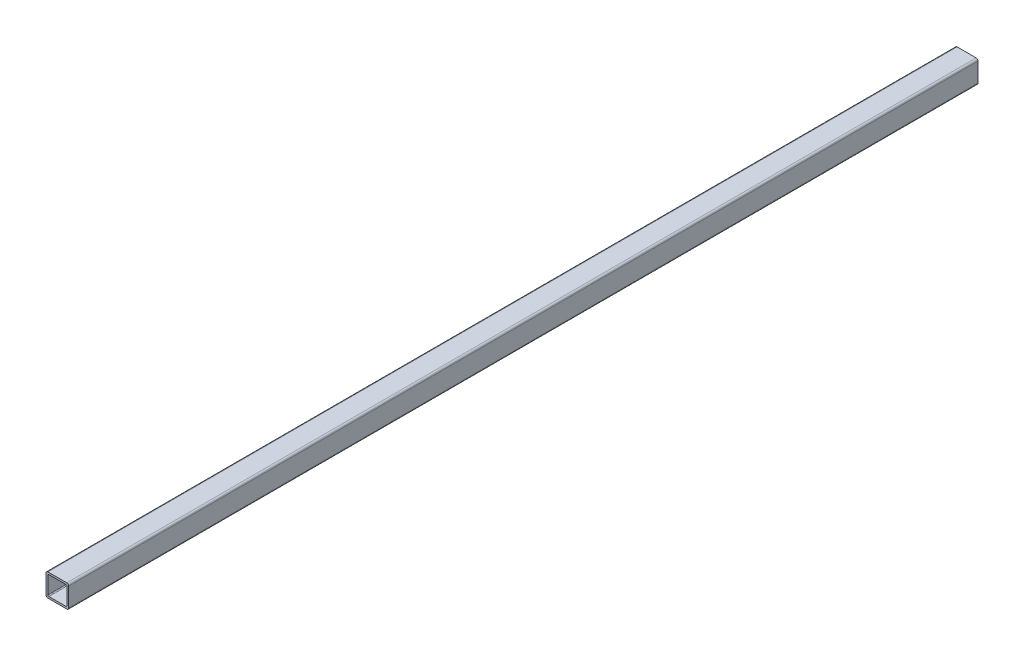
ISO-10303-21;
HEADER;
FILE_DESCRIPTION(('STEP AP214'),'2;1');
FILE_NAME('part.step','',(''),(''),'','','');
FILE_SCHEMA(('AUTOMOTIVE_DESIGN { 1 0 10303 214 1 1 1 1 }'));
ENDSEC;
DATA;
#1=APPLICATION_CONTEXT('core data for automotive mechanical design processes');
#2=APPLICATION_PROTOCOL_DEFINITION('international standard','automotive_design',2000,#1);
#3=PRODUCT_CONTEXT('',#1,'mechanical');
#4=PRODUCT('Part','Part','',(#3));
#5=PRODUCT_RELATED_PRODUCT_CATEGORY('part','',(#4));
#6=PRODUCT_DEFINITION_FORMATION('','',#4);
#7=PRODUCT_DEFINITION_CONTEXT('part definition',#1,'design');
#8=PRODUCT_DEFINITION('design','',#6,#7);
#9=PRODUCT_DEFINITION_SHAPE('','',#8);
#10=(LENGTH_UNIT() NAMED_UNIT(*) SI_UNIT(.MILLI.,.METRE.));
#11=(NAMED_UNIT(*) PLANE_ANGLE_UNIT() SI_UNIT($,.RADIAN.));
#12=(NAMED_UNIT(*) SI_UNIT($,.STERADIAN.) SOLID_ANGLE_UNIT());
#13=UNCERTAINTY_MEASURE_WITH_UNIT(LENGTH_MEASURE(1.E-05),#10,'distance_accuracy_value','');
#14=(GEOMETRIC_REPRESENTATION_CONTEXT(3) GLOBAL_UNCERTAINTY_ASSIGNED_CONTEXT((#13)) GLOBAL_UNIT_ASSIGNED_CONTEXT((#10,
#11,#12)) REPRESENTATION_CONTEXT('',''));
#15=CARTESIAN_POINT('',(0.,0.,0.));
#16=DIRECTION('',(0.,0.,1.));
#17=DIRECTION('',(1.,0.,0.));
#18=AXIS2_PLACEMENT_3D('',#15,#16,#17);
#19=CARTESIAN_POINT('',(-15.875,-15.875,762.));
#20=DIRECTION('',(0.,0.,1.));
#21=DIRECTION('',(1.,0.,0.));
#22=AXIS2_PLACEMENT_3D('',#19,#20,#21);
#23=PLANE('',#22);
#24=CARTESIAN_POINT('',(-15.875,-15.875,762.));
#25=DIRECTION('',(0.,0.,1.));
#26=DIRECTION('',(1.,0.,0.));
#27=AXIS2_PLACEMENT_3D('',#24,#25,#26);
#28=CIRCLE('',#27,3.175);
#29=CARTESIAN_POINT('',(-19.05,-15.875,762.));
#30=VERTEX_POINT('',#29);
#31=CARTESIAN_POINT('',(-15.875,-19.05,762.));
#32=VERTEX_POINT('',#31);
#33=EDGE_CURVE('E211',#30,#32,#28,.T.);
#34=ORIENTED_EDGE('',*,*,#33,.T.);
#35=DIRECTION('',(1.,0.,0.));
#36=VECTOR('',#35,1.);
#37=CARTESIAN_POINT('',(-15.875,-19.05,762.));
#38=LINE('',#37,#36);
#39=CARTESIAN_POINT('',(15.875,-19.05,762.));
#40=VERTEX_POINT('',#39);
#41=EDGE_CURVE('E214',#32,#40,#38,.T.);
#42=ORIENTED_EDGE('',*,*,#41,.T.);
#43=CARTESIAN_POINT('',(15.875,-15.875,762.));
#44=DIRECTION('',(0.,0.,1.));
#45=DIRECTION('',(1.,0.,0.));
#46=AXIS2_PLACEMENT_3D('',#43,#44,#45);
#47=CIRCLE('',#46,3.175);
#48=CARTESIAN_POINT('',(19.05,-15.875,762.));
#49=VERTEX_POINT('',#48);
#50=EDGE_CURVE('E217',#40,#49,#47,.T.);
#51=ORIENTED_EDGE('',*,*,#50,.T.);
#52=DIRECTION('',(0.,1.,0.));
#53=VECTOR('',#52,1.);
#54=CARTESIAN_POINT('',(19.05,15.875,762.));
#55=LINE('',#54,#53);
#56=CARTESIAN_POINT('',(19.05,15.875,762.));
#57=VERTEX_POINT('',#56);
#58=EDGE_CURVE('E219',#49,#57,#55,.T.);
#59=ORIENTED_EDGE('',*,*,#58,.T.);
#60=CARTESIAN_POINT('',(15.875,15.875,762.));
#61=DIRECTION('',(0.,0.,1.));
#62=DIRECTION('',(-1.,0.,0.));
#63=AXIS2_PLACEMENT_3D('',#60,#61,#62);
#64=CIRCLE('',#63,3.175);
#65=CARTESIAN_POINT('',(15.875,19.05,762.));
#66=VERTEX_POINT('',#65);
#67=EDGE_CURVE('E221',#57,#66,#64,.T.);
#68=ORIENTED_EDGE('',*,*,#67,.T.);
#69=DIRECTION('',(-1.,0.,0.));
#70=VECTOR('',#69,1.);
#71=CARTESIAN_POINT('',(-15.875,19.05,762.));
#72=LINE('',#71,#70);
#73=CARTESIAN_POINT('',(-15.875,19.05,762.));
#74=VERTEX_POINT('',#73);
#75=EDGE_CURVE('E223',#66,#74,#72,.T.);
#76=ORIENTED_EDGE('',*,*,#75,.T.);
#77=CARTESIAN_POINT('',(-15.875,15.875,762.));
#78=DIRECTION('',(0.,0.,1.));
#79=DIRECTION('',(1.,0.,0.));
#80=AXIS2_PLACEMENT_3D('',#77,#78,#79);
#81=CIRCLE('',#80,3.175);
#82=CARTESIAN_POINT('',(-19.05,15.875,762.));
#83=VERTEX_POINT('',#82);
#84=EDGE_CURVE('E225',#74,#83,#81,.T.);
#85=ORIENTED_EDGE('',*,*,#84,.T.);
#86=DIRECTION('',(0.,-1.,0.));
#87=VECTOR('',#86,1.);
#88=CARTESIAN_POINT('',(-19.05,15.875,762.));
#89=LINE('',#88,#87);
#90=EDGE_CURVE('E227',#83,#30,#89,.T.);
#91=ORIENTED_EDGE('',*,*,#90,.T.);
#92=EDGE_LOOP('',(#34,#42,#51,#59,#68,#76,#85,#91));
#93=FACE_BOUND('',#92,.T.);
#94=DIRECTION('',(0.,-1.,0.));
#95=VECTOR('',#94,1.);
#96=CARTESIAN_POINT('',(-15.875,14.2875,762.));
#97=LINE('',#96,#95);
#98=CARTESIAN_POINT('',(-15.875,14.2875,762.));
#99=VERTEX_POINT('',#98);
#100=CARTESIAN_POINT('',(-15.875,-14.2875,762.));
#101=VERTEX_POINT('',#100);
#102=EDGE_CURVE('E154',#99,#101,#97,.T.);
#103=ORIENTED_EDGE('',*,*,#102,.F.);
#104=CARTESIAN_POINT('',(-14.2875,14.2875,762.));
#105=DIRECTION('',(0.,0.,1.));
#106=DIRECTION('',(1.,0.,0.));
#107=AXIS2_PLACEMENT_3D('',#104,#105,#106);
#108=CIRCLE('',#107,1.5875);
#109=CARTESIAN_POINT('',(-14.2875,15.875,762.));
#110=VERTEX_POINT('',#109);
#111=EDGE_CURVE('E146',#110,#99,#108,.T.);
#112=ORIENTED_EDGE('',*,*,#111,.F.);
#113=DIRECTION('',(-1.,0.,0.));
#114=VECTOR('',#113,1.);
#115=CARTESIAN_POINT('',(-14.2875,15.875,762.));
#116=LINE('',#115,#114);
#117=CARTESIAN_POINT('',(14.2875,15.875,762.));
#118=VERTEX_POINT('',#117);
#119=EDGE_CURVE('E179',#118,#110,#116,.T.);
#120=ORIENTED_EDGE('',*,*,#119,.F.);
#121=CARTESIAN_POINT('',(14.2875,14.2875,762.));
#122=DIRECTION('',(0.,0.,1.));
#123=DIRECTION('',(-1.,0.,0.));
#124=AXIS2_PLACEMENT_3D('',#121,#122,#123);
#125=CIRCLE('',#124,1.5875);
#126=CARTESIAN_POINT('',(15.875,14.2875,762.));
#127=VERTEX_POINT('',#126);
#128=EDGE_CURVE('E177',#127,#118,#125,.T.);
#129=ORIENTED_EDGE('',*,*,#128,.F.);
#130=DIRECTION('',(0.,1.,0.));
#131=VECTOR('',#130,1.);
#132=CARTESIAN_POINT('',(15.875,14.2875,762.));
#133=LINE('',#132,#131);
#134=CARTESIAN_POINT('',(15.875,-14.2875,762.));
#135=VERTEX_POINT('',#134);
#136=EDGE_CURVE('E175',#135,#127,#133,.T.);
#137=ORIENTED_EDGE('',*,*,#136,.F.);
#138=CARTESIAN_POINT('',(14.2875,-14.2875,762.));
#139=DIRECTION('',(0.,0.,1.));
#140=DIRECTION('',(1.,0.,0.));
#141=AXIS2_PLACEMENT_3D('',#138,#139,#140);
#142=CIRCLE('',#141,1.5875);
#143=CARTESIAN_POINT('',(14.2875,-15.875,762.));
#144=VERTEX_POINT('',#143);
#145=EDGE_CURVE('E173',#144,#135,#142,.T.);
#146=ORIENTED_EDGE('',*,*,#145,.F.);
#147=DIRECTION('',(1.,0.,0.));
#148=VECTOR('',#147,1.);
#149=CARTESIAN_POINT('',(-14.2875,-15.875,762.));
#150=LINE('',#149,#148);
#151=CARTESIAN_POINT('',(-14.2875,-15.875,762.));
#152=VERTEX_POINT('',#151);
#153=EDGE_CURVE('E169',#152,#144,#150,.T.);
#154=ORIENTED_EDGE('',*,*,#153,.F.);
#155=CARTESIAN_POINT('',(-14.2875,-14.2875,762.));
#156=DIRECTION('',(0.,0.,1.));
#157=DIRECTION('',(1.,0.,0.));
#158=AXIS2_PLACEMENT_3D('',#155,#156,#157);
#159=CIRCLE('',#158,1.5875);
#160=EDGE_CURVE('E167',#101,#152,#159,.T.);
#161=ORIENTED_EDGE('',*,*,#160,.F.);
#162=EDGE_LOOP('',(#103,#112,#120,#129,#137,#146,#154,#161));
#163=FACE_BOUND('',#162,.T.);
#164=ADVANCED_FACE('F33',(#93,#163),#23,.T.);
#165=CARTESIAN_POINT('',(-15.875,-15.875,-762.));
#166=DIRECTION('',(0.,0.,1.));
#167=DIRECTION('',(1.,0.,0.));
#168=AXIS2_PLACEMENT_3D('',#165,#166,#167);
#169=PLANE('',#168);
#170=CARTESIAN_POINT('',(-15.875,-15.875,-762.));
#171=DIRECTION('',(0.,0.,1.));
#172=DIRECTION('',(1.,0.,0.));
#173=AXIS2_PLACEMENT_3D('',#170,#171,#172);
#174=CIRCLE('',#173,3.175);
#175=CARTESIAN_POINT('',(-19.05,-15.875,-762.));
#176=VERTEX_POINT('',#175);
#177=CARTESIAN_POINT('',(-15.875,-19.05,-762.));
#178=VERTEX_POINT('',#177);
#179=EDGE_CURVE('E162',#176,#178,#174,.T.);
#180=ORIENTED_EDGE('',*,*,#179,.F.);
#181=DIRECTION('',(0.,-1.,0.));
#182=VECTOR('',#181,1.);
#183=CARTESIAN_POINT('',(-19.05,15.875,-762.));
#184=LINE('',#183,#182);
#185=CARTESIAN_POINT('',(-19.05,15.875,-762.));
#186=VERTEX_POINT('',#185);
#187=EDGE_CURVE('E215',#186,#176,#184,.T.);
#188=ORIENTED_EDGE('',*,*,#187,.F.);
#189=CARTESIAN_POINT('',(-15.875,15.875,-762.));
#190=DIRECTION('',(0.,0.,1.));
#191=DIRECTION('',(1.,0.,0.));
#192=AXIS2_PLACEMENT_3D('',#189,#190,#191);
#193=CIRCLE('',#192,3.175);
#194=CARTESIAN_POINT('',(-15.875,19.05,-762.));
#195=VERTEX_POINT('',#194);
#196=EDGE_CURVE('E242',#195,#186,#193,.T.);
#197=ORIENTED_EDGE('',*,*,#196,.F.);
#198=DIRECTION('',(-1.,0.,0.));
#199=VECTOR('',#198,1.);
#200=CARTESIAN_POINT('',(-15.875,19.05,-762.));
#201=LINE('',#200,#199);
#202=CARTESIAN_POINT('',(15.875,19.05,-762.));
#203=VERTEX_POINT('',#202);
#204=EDGE_CURVE('E240',#203,#195,#201,.T.);
#205=ORIENTED_EDGE('',*,*,#204,.F.);
#206=CARTESIAN_POINT('',(15.875,15.875,-762.));
#207=DIRECTION('',(0.,0.,1.));
#208=DIRECTION('',(-1.,0.,0.));
#209=AXIS2_PLACEMENT_3D('',#206,#207,#208);
#210=CIRCLE('',#209,3.175);
#211=CARTESIAN_POINT('',(19.05,15.875,-762.));
#212=VERTEX_POINT('',#211);
#213=EDGE_CURVE('E238',#212,#203,#210,.T.);
#214=ORIENTED_EDGE('',*,*,#213,.F.);
#215=DIRECTION('',(0.,1.,0.));
#216=VECTOR('',#215,1.);
#217=CARTESIAN_POINT('',(19.05,15.875,-762.));
#218=LINE('',#217,#216);
#219=CARTESIAN_POINT('',(19.05,-15.875,-762.));
#220=VERTEX_POINT('',#219);
#221=EDGE_CURVE('E236',#220,#212,#218,.T.);
#222=ORIENTED_EDGE('',*,*,#221,.F.);
#223=CARTESIAN_POINT('',(15.875,-15.875,-762.));
#224=DIRECTION('',(0.,0.,1.));
#225=DIRECTION('',(1.,0.,0.));
#226=AXIS2_PLACEMENT_3D('',#223,#224,#225);
#227=CIRCLE('',#226,3.175);
#228=CARTESIAN_POINT('',(15.875,-19.05,-762.));
#229=VERTEX_POINT('',#228);
#230=EDGE_CURVE('E234',#229,#220,#227,.T.);
#231=ORIENTED_EDGE('',*,*,#230,.F.);
#232=DIRECTION('',(1.,0.,0.));
#233=VECTOR('',#232,1.);
#234=CARTESIAN_POINT('',(-15.875,-19.05,-762.));
#235=LINE('',#234,#233);
#236=EDGE_CURVE('E232',#178,#229,#235,.T.);
#237=ORIENTED_EDGE('',*,*,#236,.F.);
#238=EDGE_LOOP('',(#180,#188,#197,#205,#214,#222,#231,#237));
#239=FACE_BOUND('',#238,.T.);
#240=CARTESIAN_POINT('',(-14.2875,14.2875,-762.));
#241=DIRECTION('',(0.,0.,1.));
#242=DIRECTION('',(1.,0.,0.));
#243=AXIS2_PLACEMENT_3D('',#240,#241,#242);
#244=CIRCLE('',#243,1.5875);
#245=CARTESIAN_POINT('',(-14.2875,15.875,-762.));
#246=VERTEX_POINT('',#245);
#247=CARTESIAN_POINT('',(-15.875,14.2875,-762.));
#248=VERTEX_POINT('',#247);
#249=EDGE_CURVE('E56',#246,#248,#244,.T.);
#250=ORIENTED_EDGE('',*,*,#249,.T.);
#251=DIRECTION('',(0.,-1.,0.));
#252=VECTOR('',#251,1.);
#253=CARTESIAN_POINT('',(-15.875,14.2875,-762.));
#254=LINE('',#253,#252);
#255=CARTESIAN_POINT('',(-15.875,-14.2875,-762.));
#256=VERTEX_POINT('',#255);
#257=EDGE_CURVE('E161',#248,#256,#254,.T.);
#258=ORIENTED_EDGE('',*,*,#257,.T.);
#259=CARTESIAN_POINT('',(-14.2875,-14.2875,-762.));
#260=DIRECTION('',(0.,0.,1.));
#261=DIRECTION('',(1.,0.,0.));
#262=AXIS2_PLACEMENT_3D('',#259,#260,#261);
#263=CIRCLE('',#262,1.5875);
#264=CARTESIAN_POINT('',(-14.2875,-15.875,-762.));
#265=VERTEX_POINT('',#264);
#266=EDGE_CURVE('E183',#256,#265,#263,.T.);
#267=ORIENTED_EDGE('',*,*,#266,.T.);
#268=DIRECTION('',(1.,0.,0.));
#269=VECTOR('',#268,1.);
#270=CARTESIAN_POINT('',(-14.2875,-15.875,-762.));
#271=LINE('',#270,#269);
#272=CARTESIAN_POINT('',(14.2875,-15.875,-762.));
#273=VERTEX_POINT('',#272);
#274=EDGE_CURVE('E186',#265,#273,#271,.T.);
#275=ORIENTED_EDGE('',*,*,#274,.T.);
#276=CARTESIAN_POINT('',(14.2875,-14.2875,-762.));
#277=DIRECTION('',(0.,0.,1.));
#278=DIRECTION('',(1.,0.,0.));
#279=AXIS2_PLACEMENT_3D('',#276,#277,#278);
#280=CIRCLE('',#279,1.5875);
#281=CARTESIAN_POINT('',(15.875,-14.2875,-762.));
#282=VERTEX_POINT('',#281);
#283=EDGE_CURVE('E189',#273,#282,#280,.T.);
#284=ORIENTED_EDGE('',*,*,#283,.T.);
#285=DIRECTION('',(0.,1.,0.));
#286=VECTOR('',#285,1.);
#287=CARTESIAN_POINT('',(15.875,14.2875,-762.));
#288=LINE('',#287,#286);
#289=CARTESIAN_POINT('',(15.875,14.2875,-762.));
#290=VERTEX_POINT('',#289);
#291=EDGE_CURVE('E192',#282,#290,#288,.T.);
#292=ORIENTED_EDGE('',*,*,#291,.T.);
#293=CARTESIAN_POINT('',(14.2875,14.2875,-762.));
#294=DIRECTION('',(0.,0.,1.));
#295=DIRECTION('',(-1.,0.,0.));
#296=AXIS2_PLACEMENT_3D('',#293,#294,#295);
#297=CIRCLE('',#296,1.5875);
#298=CARTESIAN_POINT('',(14.2875,15.875,-762.));
#299=VERTEX_POINT('',#298);
#300=EDGE_CURVE('E195',#290,#299,#297,.T.);
#301=ORIENTED_EDGE('',*,*,#300,.T.);
#302=DIRECTION('',(-1.,0.,0.));
#303=VECTOR('',#302,1.);
#304=CARTESIAN_POINT('',(-14.2875,15.875,-762.));
#305=LINE('',#304,#303);
#306=EDGE_CURVE('E155',#299,#246,#305,.T.);
#307=ORIENTED_EDGE('',*,*,#306,.T.);
#308=EDGE_LOOP('',(#250,#258,#267,#275,#284,#292,#301,#307));
#309=FACE_BOUND('',#308,.T.);
#310=ADVANCED_FACE('F272',(#239,#309),#169,.F.);
#311=CARTESIAN_POINT('',(-15.875,-15.875,762.));
#312=DIRECTION('',(0.,0.,-1.));
#313=DIRECTION('',(-1.,0.,0.));
#314=AXIS2_PLACEMENT_3D('',#311,#312,#313);
#315=CYLINDRICAL_SURFACE('',#314,3.175);
#316=ORIENTED_EDGE('',*,*,#179,.T.);
#317=DIRECTION('',(0.,0.,-1.));
#318=VECTOR('',#317,1.);
#319=CARTESIAN_POINT('',(-15.875,-19.05,762.));
#320=LINE('',#319,#318);
#321=EDGE_CURVE('E11',#32,#178,#320,.T.);
#322=ORIENTED_EDGE('',*,*,#321,.F.);
#323=ORIENTED_EDGE('',*,*,#33,.F.);
#324=DIRECTION('',(0.,0.,-1.));
#325=VECTOR('',#324,1.);
#326=CARTESIAN_POINT('',(-19.05,-15.875,762.));
#327=LINE('',#326,#325);
#328=EDGE_CURVE('E229',#30,#176,#327,.T.);
#329=ORIENTED_EDGE('',*,*,#328,.T.);
#330=EDGE_LOOP('',(#316,#322,#323,#329));
#331=FACE_BOUND('',#330,.T.);
#332=ADVANCED_FACE('F35',(#331),#315,.T.);
#333=CARTESIAN_POINT('',(-15.875,-19.05,762.));
#334=DIRECTION('',(0.,1.,0.));
#335=DIRECTION('',(-1.,0.,0.));
#336=AXIS2_PLACEMENT_3D('',#333,#334,#335);
#337=PLANE('',#336);
#338=ORIENTED_EDGE('',*,*,#236,.T.);
#339=DIRECTION('',(0.,0.,-1.));
#340=VECTOR('',#339,1.);
#341=CARTESIAN_POINT('',(15.875,-19.05,762.));
#342=LINE('',#341,#340);
#343=EDGE_CURVE('E41',#40,#229,#342,.T.);
#344=ORIENTED_EDGE('',*,*,#343,.F.);
#345=ORIENTED_EDGE('',*,*,#41,.F.);
#346=ORIENTED_EDGE('',*,*,#321,.T.);
#347=EDGE_LOOP('',(#338,#344,#345,#346));
#348=FACE_BOUND('',#347,.T.);
#349=ADVANCED_FACE('F289',(#348),#337,.F.);
#350=CARTESIAN_POINT('',(15.875,-15.875,762.));
#351=DIRECTION('',(0.,0.,-1.));
#352=DIRECTION('',(-1.,0.,0.));
#353=AXIS2_PLACEMENT_3D('',#350,#351,#352);
#354=CYLINDRICAL_SURFACE('',#353,3.175);
#355=ORIENTED_EDGE('',*,*,#230,.T.);
#356=DIRECTION('',(0.,0.,-1.));
#357=VECTOR('',#356,1.);
#358=CARTESIAN_POINT('',(19.05,-15.875,762.));
#359=LINE('',#358,#357);
#360=EDGE_CURVE('E259',#49,#220,#359,.T.);
#361=ORIENTED_EDGE('',*,*,#360,.F.);
#362=ORIENTED_EDGE('',*,*,#50,.F.);
#363=ORIENTED_EDGE('',*,*,#343,.T.);
#364=EDGE_LOOP('',(#355,#361,#362,#363));
#365=FACE_BOUND('',#364,.T.);
#366=ADVANCED_FACE('F266',(#365),#354,.T.);
#367=CARTESIAN_POINT('',(19.05,15.875,762.));
#368=DIRECTION('',(-1.,0.,0.));
#369=DIRECTION('',(0.,0.,1.));
#370=AXIS2_PLACEMENT_3D('',#367,#368,#369);
#371=PLANE('',#370);
#372=ORIENTED_EDGE('',*,*,#221,.T.);
#373=DIRECTION('',(0.,0.,-1.));
#374=VECTOR('',#373,1.);
#375=CARTESIAN_POINT('',(19.05,15.875,762.));
#376=LINE('',#375,#374);
#377=EDGE_CURVE('E256',#57,#212,#376,.T.);
#378=ORIENTED_EDGE('',*,*,#377,.F.);
#379=ORIENTED_EDGE('',*,*,#58,.F.);
#380=ORIENTED_EDGE('',*,*,#360,.T.);
#381=EDGE_LOOP('',(#372,#378,#379,#380));
#382=FACE_BOUND('',#381,.T.);
#383=ADVANCED_FACE('F278',(#382),#371,.F.);
#384=CARTESIAN_POINT('',(15.875,15.875,762.));
#385=DIRECTION('',(0.,0.,-1.));
#386=DIRECTION('',(-1.,0.,0.));
#387=AXIS2_PLACEMENT_3D('',#384,#385,#386);
#388=CYLINDRICAL_SURFACE('',#387,3.175);
#389=ORIENTED_EDGE('',*,*,#213,.T.);
#390=DIRECTION('',(0.,0.,-1.));
#391=VECTOR('',#390,1.);
#392=CARTESIAN_POINT('',(15.875,19.05,762.));
#393=LINE('',#392,#391);
#394=EDGE_CURVE('E253',#66,#203,#393,.T.);
#395=ORIENTED_EDGE('',*,*,#394,.F.);
#396=ORIENTED_EDGE('',*,*,#67,.F.);
#397=ORIENTED_EDGE('',*,*,#377,.T.);
#398=EDGE_LOOP('',(#389,#395,#396,#397));
#399=FACE_BOUND('',#398,.T.);
#400=ADVANCED_FACE('F282',(#399),#388,.T.);
#401=CARTESIAN_POINT('',(-15.875,19.05,762.));
#402=DIRECTION('',(0.,-1.,0.));
#403=DIRECTION('',(0.,0.,-1.));
#404=AXIS2_PLACEMENT_3D('',#401,#402,#403);
#405=PLANE('',#404);
#406=ORIENTED_EDGE('',*,*,#204,.T.);
#407=DIRECTION('',(0.,0.,-1.));
#408=VECTOR('',#407,1.);
#409=CARTESIAN_POINT('',(-15.875,19.05,762.));
#410=LINE('',#409,#408);
#411=EDGE_CURVE('E250',#74,#195,#410,.T.);
#412=ORIENTED_EDGE('',*,*,#411,.F.);
#413=ORIENTED_EDGE('',*,*,#75,.F.);
#414=ORIENTED_EDGE('',*,*,#394,.T.);
#415=EDGE_LOOP('',(#406,#412,#413,#414));
#416=FACE_BOUND('',#415,.T.);
#417=ADVANCED_FACE('F302',(#416),#405,.F.);
#418=CARTESIAN_POINT('',(-15.875,15.875,762.));
#419=DIRECTION('',(0.,0.,-1.));
#420=DIRECTION('',(-1.,0.,0.));
#421=AXIS2_PLACEMENT_3D('',#418,#419,#420);
#422=CYLINDRICAL_SURFACE('',#421,3.175);
#423=ORIENTED_EDGE('',*,*,#196,.T.);
#424=DIRECTION('',(0.,0.,-1.));
#425=VECTOR('',#424,1.);
#426=CARTESIAN_POINT('',(-19.05,15.875,762.));
#427=LINE('',#426,#425);
#428=EDGE_CURVE('E247',#83,#186,#427,.T.);
#429=ORIENTED_EDGE('',*,*,#428,.F.);
#430=ORIENTED_EDGE('',*,*,#84,.F.);
#431=ORIENTED_EDGE('',*,*,#411,.T.);
#432=EDGE_LOOP('',(#423,#429,#430,#431));
#433=FACE_BOUND('',#432,.T.);
#434=ADVANCED_FACE('F300',(#433),#422,.T.);
#435=CARTESIAN_POINT('',(-19.05,15.875,762.));
#436=DIRECTION('',(1.,0.,0.));
#437=DIRECTION('',(0.,1.,0.));
#438=AXIS2_PLACEMENT_3D('',#435,#436,#437);
#439=PLANE('',#438);
#440=ORIENTED_EDGE('',*,*,#187,.T.);
#441=ORIENTED_EDGE('',*,*,#328,.F.);
#442=ORIENTED_EDGE('',*,*,#90,.F.);
#443=ORIENTED_EDGE('',*,*,#428,.T.);
#444=EDGE_LOOP('',(#440,#441,#442,#443));
#445=FACE_BOUND('',#444,.T.);
#446=ADVANCED_FACE('F295',(#445),#439,.F.);
#447=CARTESIAN_POINT('',(-14.2875,14.2875,762.));
#448=DIRECTION('',(0.,0.,-1.));
#449=DIRECTION('',(-1.,0.,0.));
#450=AXIS2_PLACEMENT_3D('',#447,#448,#449);
#451=CYLINDRICAL_SURFACE('',#450,1.5875);
#452=ORIENTED_EDGE('',*,*,#249,.F.);
#453=DIRECTION('',(0.,0.,-1.));
#454=VECTOR('',#453,1.);
#455=CARTESIAN_POINT('',(-14.2875,15.875,762.));
#456=LINE('',#455,#454);
#457=EDGE_CURVE('E150',#110,#246,#456,.T.);
#458=ORIENTED_EDGE('',*,*,#457,.F.);
#459=ORIENTED_EDGE('',*,*,#111,.T.);
#460=DIRECTION('',(0.,0.,-1.));
#461=VECTOR('',#460,1.);
#462=CARTESIAN_POINT('',(-15.875,14.2875,762.));
#463=LINE('',#462,#461);
#464=EDGE_CURVE('E149',#99,#248,#463,.T.);
#465=ORIENTED_EDGE('',*,*,#464,.T.);
#466=EDGE_LOOP('',(#452,#458,#459,#465));
#467=FACE_BOUND('',#466,.T.);
#468=ADVANCED_FACE('F148',(#467),#451,.F.);
#469=CARTESIAN_POINT('',(-15.875,14.2875,762.));
#470=DIRECTION('',(1.,0.,0.));
#471=DIRECTION('',(0.,0.,-1.));
#472=AXIS2_PLACEMENT_3D('',#469,#470,#471);
#473=PLANE('',#472);
#474=ORIENTED_EDGE('',*,*,#257,.F.);
#475=ORIENTED_EDGE('',*,*,#464,.F.);
#476=ORIENTED_EDGE('',*,*,#102,.T.);
#477=DIRECTION('',(0.,0.,-1.));
#478=VECTOR('',#477,1.);
#479=CARTESIAN_POINT('',(-15.875,-14.2875,762.));
#480=LINE('',#479,#478);
#481=EDGE_CURVE('E163',#101,#256,#480,.T.);
#482=ORIENTED_EDGE('',*,*,#481,.T.);
#483=EDGE_LOOP('',(#474,#475,#476,#482));
#484=FACE_BOUND('',#483,.T.);
#485=ADVANCED_FACE('F158',(#484),#473,.T.);
#486=CARTESIAN_POINT('',(-14.2875,-14.2875,762.));
#487=DIRECTION('',(0.,0.,-1.));
#488=DIRECTION('',(-1.,0.,0.));
#489=AXIS2_PLACEMENT_3D('',#486,#487,#488);
#490=CYLINDRICAL_SURFACE('',#489,1.5875);
#491=ORIENTED_EDGE('',*,*,#266,.F.);
#492=ORIENTED_EDGE('',*,*,#481,.F.);
#493=ORIENTED_EDGE('',*,*,#160,.T.);
#494=DIRECTION('',(0.,0.,-1.));
#495=VECTOR('',#494,1.);
#496=CARTESIAN_POINT('',(-14.2875,-15.875,762.));
#497=LINE('',#496,#495);
#498=EDGE_CURVE('E208',#152,#265,#497,.T.);
#499=ORIENTED_EDGE('',*,*,#498,.T.);
#500=EDGE_LOOP('',(#491,#492,#493,#499));
#501=FACE_BOUND('',#500,.T.);
#502=ADVANCED_FACE('F327',(#501),#490,.F.);
#503=CARTESIAN_POINT('',(-14.2875,-15.875,762.));
#504=DIRECTION('',(0.,1.,0.));
#505=DIRECTION('',(0.,0.,1.));
#506=AXIS2_PLACEMENT_3D('',#503,#504,#505);
#507=PLANE('',#506);
#508=ORIENTED_EDGE('',*,*,#274,.F.);
#509=ORIENTED_EDGE('',*,*,#498,.F.);
#510=ORIENTED_EDGE('',*,*,#153,.T.);
#511=DIRECTION('',(0.,0.,-1.));
#512=VECTOR('',#511,1.);
#513=CARTESIAN_POINT('',(14.2875,-15.875,762.));
#514=LINE('',#513,#512);
#515=EDGE_CURVE('E206',#144,#273,#514,.T.);
#516=ORIENTED_EDGE('',*,*,#515,.T.);
#517=EDGE_LOOP('',(#508,#509,#510,#516));
#518=FACE_BOUND('',#517,.T.);
#519=ADVANCED_FACE('F331',(#518),#507,.T.);
#520=CARTESIAN_POINT('',(14.2875,-14.2875,762.));
#521=DIRECTION('',(0.,0.,-1.));
#522=DIRECTION('',(-1.,0.,0.));
#523=AXIS2_PLACEMENT_3D('',#520,#521,#522);
#524=CYLINDRICAL_SURFACE('',#523,1.5875);
#525=ORIENTED_EDGE('',*,*,#283,.F.);
#526=ORIENTED_EDGE('',*,*,#515,.F.);
#527=ORIENTED_EDGE('',*,*,#145,.T.);
#528=DIRECTION('',(0.,0.,-1.));
#529=VECTOR('',#528,1.);
#530=CARTESIAN_POINT('',(15.875,-14.2875,762.));
#531=LINE('',#530,#529);
#532=EDGE_CURVE('E204',#135,#282,#531,.T.);
#533=ORIENTED_EDGE('',*,*,#532,.T.);
#534=EDGE_LOOP('',(#525,#526,#527,#533));
#535=FACE_BOUND('',#534,.T.);
#536=ADVANCED_FACE('F337',(#535),#524,.F.);
#537=CARTESIAN_POINT('',(15.875,14.2875,762.));
#538=DIRECTION('',(-1.,0.,0.));
#539=DIRECTION('',(0.,-1.,0.));
#540=AXIS2_PLACEMENT_3D('',#537,#538,#539);
#541=PLANE('',#540);
#542=ORIENTED_EDGE('',*,*,#291,.F.);
#543=ORIENTED_EDGE('',*,*,#532,.F.);
#544=ORIENTED_EDGE('',*,*,#136,.T.);
#545=DIRECTION('',(0.,0.,-1.));
#546=VECTOR('',#545,1.);
#547=CARTESIAN_POINT('',(15.875,14.2875,762.));
#548=LINE('',#547,#546);
#549=EDGE_CURVE('E202',#127,#290,#548,.T.);
#550=ORIENTED_EDGE('',*,*,#549,.T.);
#551=EDGE_LOOP('',(#542,#543,#544,#550));
#552=FACE_BOUND('',#551,.T.);
#553=ADVANCED_FACE('F341',(#552),#541,.T.);
#554=CARTESIAN_POINT('',(14.2875,14.2875,762.));
#555=DIRECTION('',(0.,0.,-1.));
#556=DIRECTION('',(-1.,0.,0.));
#557=AXIS2_PLACEMENT_3D('',#554,#555,#556);
#558=CYLINDRICAL_SURFACE('',#557,1.5875);
#559=ORIENTED_EDGE('',*,*,#300,.F.);
#560=ORIENTED_EDGE('',*,*,#549,.F.);
#561=ORIENTED_EDGE('',*,*,#128,.T.);
#562=DIRECTION('',(0.,0.,-1.));
#563=VECTOR('',#562,1.);
#564=CARTESIAN_POINT('',(14.2875,15.875,762.));
#565=LINE('',#564,#563);
#566=EDGE_CURVE('E48',#118,#299,#565,.T.);
#567=ORIENTED_EDGE('',*,*,#566,.T.);
#568=EDGE_LOOP('',(#559,#560,#561,#567));
#569=FACE_BOUND('',#568,.T.);
#570=ADVANCED_FACE('F345',(#569),#558,.F.);
#571=CARTESIAN_POINT('',(-14.2875,15.875,762.));
#572=DIRECTION('',(0.,-1.,0.));
#573=DIRECTION('',(0.,0.,-1.));
#574=AXIS2_PLACEMENT_3D('',#571,#572,#573);
#575=PLANE('',#574);
#576=ORIENTED_EDGE('',*,*,#306,.F.);
#577=ORIENTED_EDGE('',*,*,#566,.F.);
#578=ORIENTED_EDGE('',*,*,#119,.T.);
#579=ORIENTED_EDGE('',*,*,#457,.T.);
#580=EDGE_LOOP('',(#576,#577,#578,#579));
#581=FACE_BOUND('',#580,.T.);
#582=ADVANCED_FACE('F349',(#581),#575,.T.);
#583=CLOSED_SHELL('',(#164,#310,#332,#349,#366,#383,#400,#417,#434,#446,#468,#485,#502,#519,
#536,#553,#570,#582));
#584=MANIFOLD_SOLID_BREP('B2',#583);
#585=ADVANCED_BREP_SHAPE_REPRESENTATION('',(#18,#584),#14);
#586=SHAPE_DEFINITION_REPRESENTATION(#9,#585);
ENDSEC;
END-ISO-10303-21;
